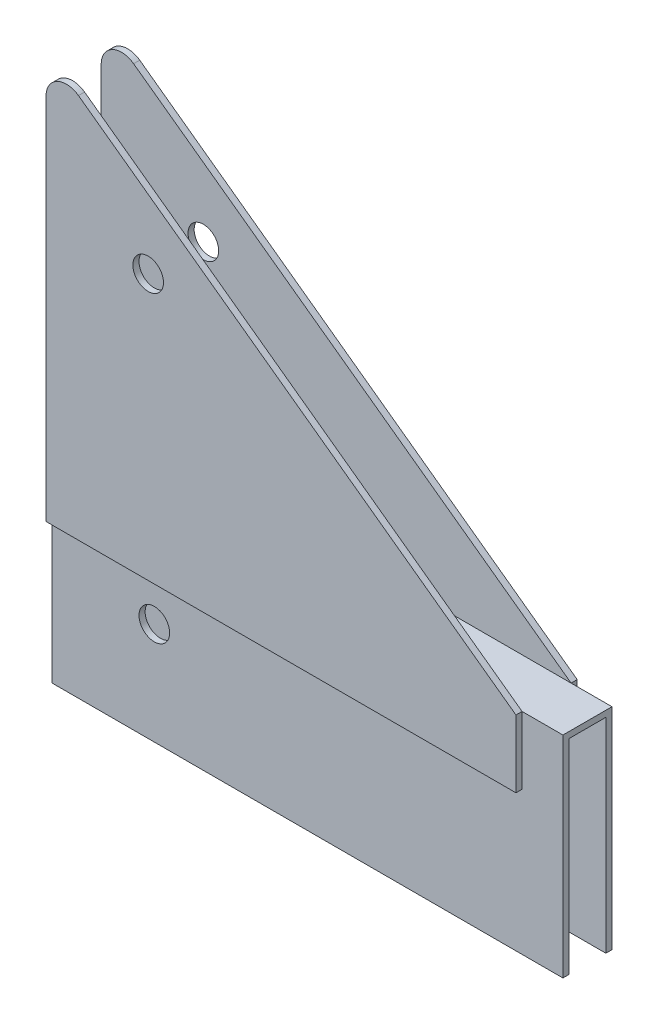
from build123d import *

# Parameters (mm, degrees)
BOSS_EXTRU_1_DEPTH               = 250
BOSS_EXTRU_2_DEPTH               = 3
CONG_1_R                         = 10
R_P_TITION_LIN_AIRE1_COUNT       = 2
R_P_TITION_LIN_AIRE1_PITCH       = 27
CONG_1_OF_R_P_TITION_LIN_AIRE1_R = 10
ESQUISSE4_R                      = 7.5
ENL_V_MAT_EXTRU_1_DEPTH          = 363.213102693


with BuildPart() as part:
    # Esquisse1 → Boss.-Extru.1 (new body)
    with BuildSketch(Plane(origin=(0, 0, 0), x_dir=(0, 0, -1), z_dir=(1, 0, 0))):
        Polygon((0, 0), (0, 100), (18, 100), (18, 0), (21, 0), (21, 103), (-3, 103), (-3, 0), align=None)
    extrude(amount=BOSS_EXTRU_1_DEPTH)

    # Esquisse3 → Boss.-Extru.2 (add)
    with BuildSketch(Plane.XY.offset(3)):
        Polygon((0, 70), (0, 270), (230, 103), (230, 70), align=None)
    boss_extru_2 = extrude(amount=BOSS_EXTRU_2_DEPTH)

    # Cong_1
    cong_1_edges = [part.edges().sort_by_distance(p)[0] for p in [
        (0, 270, 4.5),
    ]]
    fillet(cong_1_edges, radius=CONG_1_R)

    # R_p_tition lin_aire1: Boss.-Extru.2 ×2
    with Locations(*[(0, 0, -i * R_P_TITION_LIN_AIRE1_PITCH) for i in range(1, R_P_TITION_LIN_AIRE1_COUNT)]):
        add(boss_extru_2)

    # Cong_1 of R_p_tition lin_aire1
    cong_1_of_r_p_tition_lin_aire1_edges = [part.edges().sort_by_distance(p)[0] for p in [
        (0, 270, -22.5),
    ]]
    fillet(cong_1_of_r_p_tition_lin_aire1_edges, radius=CONG_1_OF_R_P_TITION_LIN_AIRE1_R)

    # Esquisse4 → Enl_v. mat.-Extru.1 (cut, through all)
    with BuildSketch(Plane.XY.offset(6)):
        with Locations((50, 200)):
            Circle(ESQUISSE4_R)
        with Locations(Location((50, 50, 0), (0, 0, 270))):
            Circle(ESQUISSE4_R)
    extrude(amount=-ENL_V_MAT_EXTRU_1_DEPTH, mode=Mode.SUBTRACT)


solid = part.part
